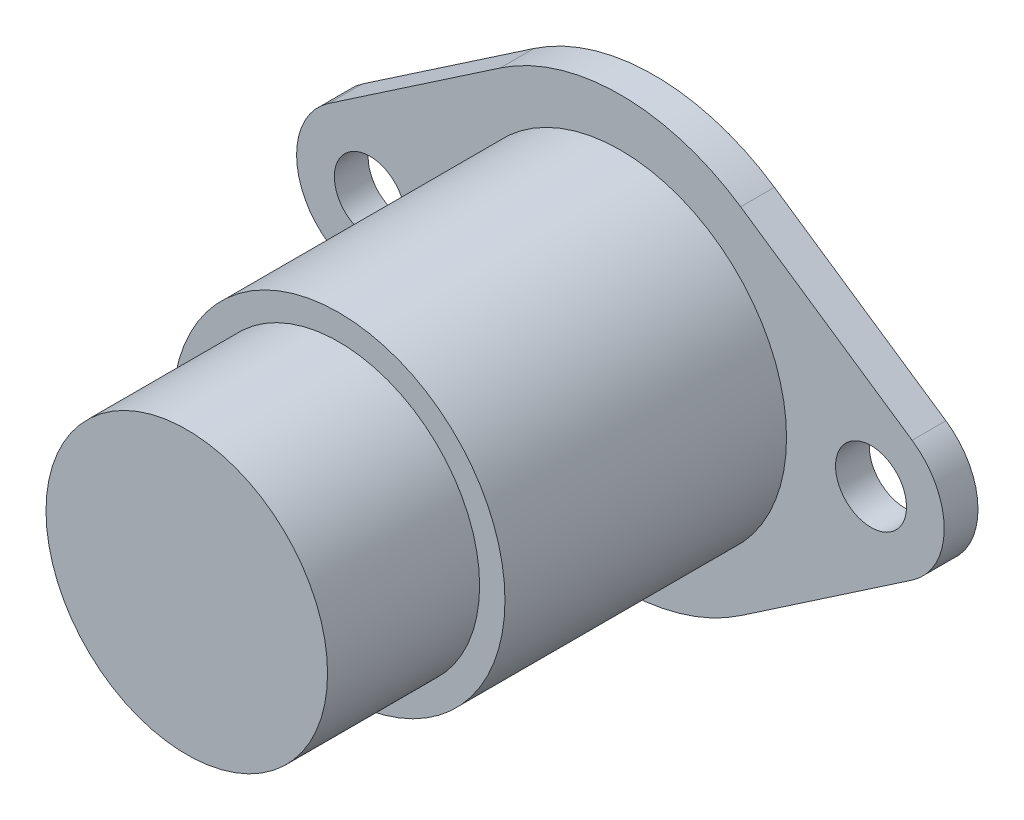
from build123d import *

# Parameters (mm, degrees)
BOSS_EXTRUDE1_DEPTH = 1.524
SKETCH2_R           = 7.493
BOSS_EXTRUDE2_DEPTH = 12.7
SKETCH3_R           = 1.6002
CUT_EXTRUDE1_DEPTH  = 1.524
SKETCH4_R           = 6.985
CUT_EXTRUDE2_DEPTH  = 10.16
SKETCH5_R           = 5.969
BOSS_EXTRUDE3_DEPTH = 9.906
SKETCH_1_R          = 6.35
EXTRUDE_1_DEPTH     = 6.858


with BuildPart() as part:
    # Sketch1 → Boss-Extrude1 (new body)
    with BuildSketch(Plane.XY):
        with BuildLine():
            Line((5.42247191, 7.984854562), (13.15805618, 2.731660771))
            ThreePointArc((13.15805618, 2.731660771), (14.605, 0), (13.15805618, -2.731660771))
            Line((13.15805618, -2.731660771), (5.42247191, -7.984854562))
            ThreePointArc((5.42247191, -7.984854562), (0, -9.652), (-5.42247191, -7.984854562))
            Line((-5.42247191, -7.984854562), (-13.15805618, -2.731660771))
            ThreePointArc((-13.15805618, -2.731660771), (-14.605, 0), (-13.15805618, 2.731660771))
            Line((-13.15805618, 2.731660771), (-5.42247191, 7.984854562))
            ThreePointArc((-5.42247191, 7.984854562), (0, 9.652), (5.42247191, 7.984854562))
        make_face()
    extrude(amount=BOSS_EXTRUDE1_DEPTH)

    # Sketch2 → Boss-Extrude2 (add)
    with BuildSketch(Plane.XY.offset(1.524)):
        with Locations(Location((0, 0, 0), (0, 0, 180))):
            Circle(SKETCH2_R)
    extrude(amount=BOSS_EXTRUDE2_DEPTH)

    # Sketch3 → Cut-Extrude1 (cut)
    with BuildSketch(Plane.XY.offset(1.524)):
        with Locations((-11.303, 0)):
            Circle(SKETCH3_R)
        with Locations((11.303, 0)):
            Circle(SKETCH3_R)
    extrude(amount=-CUT_EXTRUDE1_DEPTH, mode=Mode.SUBTRACT)

    # Sketch4 → Cut-Extrude2 (cut)
    with BuildSketch(Plane(origin=(0, 0, 0), x_dir=(-1, 0, 0), z_dir=(0, 0, -1))):
        Circle(SKETCH4_R)
    extrude(amount=-CUT_EXTRUDE2_DEPTH, mode=Mode.SUBTRACT)


with BuildPart() as body_2:
    # Sketch5 → Boss-Extrude3 (new body)
    with BuildSketch(Plane(origin=(0, 0, 10.16), x_dir=(-1, 0, 0), z_dir=(0, 0, -1))):
        Circle(SKETCH5_R)
    extrude(amount=BOSS_EXTRUDE3_DEPTH)


with BuildPart() as body_3:
    # Sketch 1 → Extrude 1 (new body)
    with BuildSketch(Plane.XY.offset(14.224)):
        Circle(SKETCH_1_R)
    extrude(amount=EXTRUDE_1_DEPTH)


solid = Compound([part.part, body_2.part, body_3.part])
